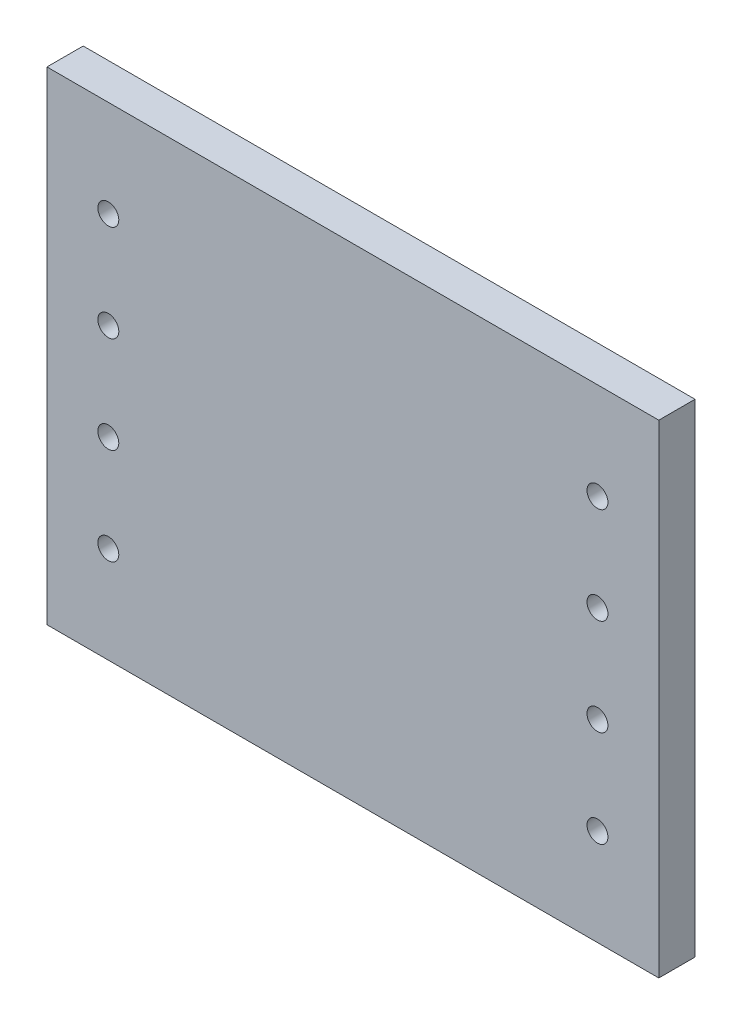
from build123d import *

# Parameters (mm, degrees)
SKETCH1_W                       = 321.691
SKETCH1_H                       = 254
BASE_EXTRUDE_DEPTH              = 19.05
BOSS_EXTRUDE1_DEPTH             = 15.875
SKETCH3_W                       = 139.7
SKETCH3_H                       = 119.186428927
CUT_EXTRUDE1_DEPTH              = 15.875
FILLET3_R                       = 2.54
FILLET5_R                       = 6.35
FILLET6_R                       = 2.54
CBORE_FOR_M10_SHCS1_D           = 11
CBORE_FOR_M10_SHCS1_CBORE_D     = 18
CBORE_FOR_M10_SHCS1_CBORE_DEPTH = 10
LPATTERN1_COUNT                 = 4
LPATTERN1_PITCH                 = 50.8
CBORE_FOR_M10_SHCS2_D           = 11
CBORE_FOR_M10_SHCS2_CBORE_D     = 18
CBORE_FOR_M10_SHCS2_CBORE_DEPTH = 10
LPATTERN2_COUNT                 = 4
LPATTERN2_PITCH                 = 50.8


with BuildPart() as part:
    # Sketch1 → Base-Extrude (new body)
    with BuildSketch(Plane.XY):
        with Locations((184.326529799, 339.562514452)):
            Rectangle(SKETCH1_W, SKETCH1_H)
    extrude(amount=BASE_EXTRUDE_DEPTH)

    # Sketch2 → Boss-Extrude1 (add)
    with BuildSketch(Plane(origin=(0, 0, 0), x_dir=(-1, 0, 0), z_dir=(0, 0, -1))):
        Polygon((-273.226529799, 392.273888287), (-273.226529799, 245.776085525), (-95.426529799, 245.776085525), (-95.426529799, 392.273888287), (-105.142059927, 403.062514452), (-263.51099967, 403.062514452), align=None)
    extrude(amount=BOSS_EXTRUDE1_DEPTH)

    # Sketch3 → Cut-Extrude1 (cut)
    with BuildSketch(Plane(origin=(0, 0, -15.875), x_dir=(-1, 0, 0), z_dir=(0, 0, -1))):
        with Locations((-184.326529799, 324.419299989)):
            Rectangle(SKETCH3_W, SKETCH3_H)
    extrude(amount=-CUT_EXTRUDE1_DEPTH, mode=Mode.SUBTRACT)

    # Fillet3
    fillet3_edges = [part.edges().sort_by_distance(p)[0] for p in [
        (95.426529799, 319.024986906, 0),
        (100.284294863, 397.668201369, 0),
        (184.326529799, 403.062514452, 0),
        (268.368764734, 397.668201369, 0),
        (273.226529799, 319.024986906, 0),
        (184.326529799, 245.776085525, 0),
    ]]
    fillet(fillet3_edges, radius=FILLET3_R)

    # Fillet5
    fillet5_edges = [part.edges().sort_by_distance(p)[0] for p in [
        (254.176529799, 264.826085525, -7.9375),
        (114.476529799, 264.826085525, -7.9375),
        (114.476529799, 384.012514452, -7.9375),
        (254.176529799, 384.012514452, -7.9375),
    ]]
    fillet(fillet5_edges, radius=FILLET5_R)

    # Fillet6
    fillet6_edges = [part.edges().sort_by_distance(p)[0] for p in [
        (254.176529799, 324.419299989, 0),
        (184.326529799, 384.012514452, 0),
        (184.326529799, 264.826085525, 0),
        (114.476529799, 324.419299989, 0),
        (116.336401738, 266.685957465, 0),
        (116.336401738, 382.152642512, 0),
        (252.316657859, 266.685957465, 0),
        (252.316657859, 382.152642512, 0),
    ]]
    fillet(fillet6_edges, radius=FILLET6_R)

    # CBORE for M10 SHCS1 (through all)
    with Locations(Plane(origin=(0, 0, 0), x_dir=(-1, 0, 0), z_dir=(0, 0, -1))):
        with Locations((-312.914029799, 415.762514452)):
            cbore_for_m10_shcs1 = CounterBoreHole(CBORE_FOR_M10_SHCS1_D / 2, CBORE_FOR_M10_SHCS1_CBORE_D / 2, CBORE_FOR_M10_SHCS1_CBORE_DEPTH)

    # LPattern1: CBORE for M10 SHCS1 ×4
    with Locations(*[(0, -i * LPATTERN1_PITCH, 0) for i in range(1, LPATTERN1_COUNT)]):
        add(cbore_for_m10_shcs1, mode=Mode.SUBTRACT)

    # CBORE for M10 SHCS2 (through all)
    with Locations(Plane(origin=(0, 0, 0), x_dir=(-1, 0, 0), z_dir=(0, 0, -1))):
        with Locations((-55.739029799, 415.762514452)):
            cbore_for_m10_shcs2 = CounterBoreHole(CBORE_FOR_M10_SHCS2_D / 2, CBORE_FOR_M10_SHCS2_CBORE_D / 2, CBORE_FOR_M10_SHCS2_CBORE_DEPTH)

    # LPattern2: CBORE for M10 SHCS2 ×4
    with Locations(*[(0, -i * LPATTERN2_PITCH, 0) for i in range(1, LPATTERN2_COUNT)]):
        add(cbore_for_m10_shcs2, mode=Mode.SUBTRACT)


solid = part.part
